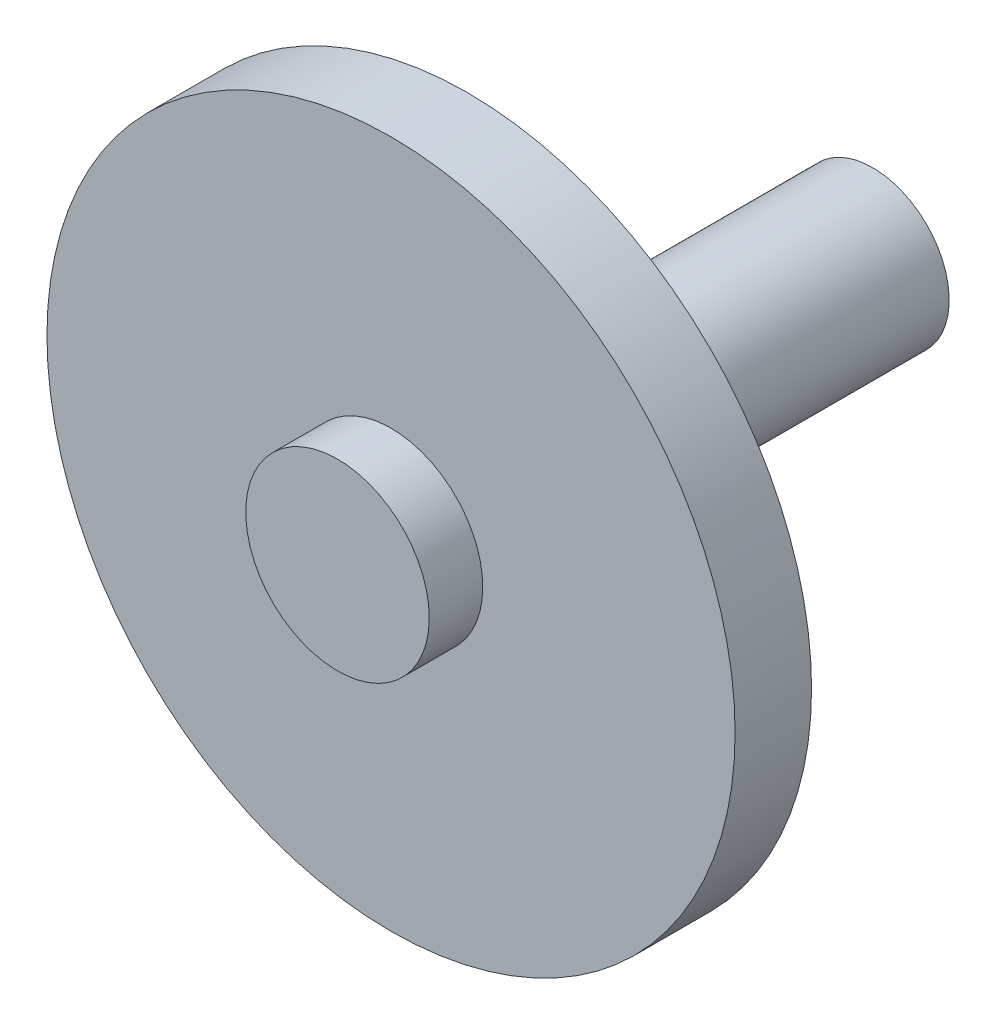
ISO-10303-21;
HEADER;
FILE_DESCRIPTION(('STEP AP214'),'2;1');
FILE_NAME('part.step','',(''),(''),'','','');
FILE_SCHEMA(('AUTOMOTIVE_DESIGN { 1 0 10303 214 1 1 1 1 }'));
ENDSEC;
DATA;
#1=APPLICATION_CONTEXT('core data for automotive mechanical design processes');
#2=APPLICATION_PROTOCOL_DEFINITION('international standard','automotive_design',2000,#1);
#3=PRODUCT_CONTEXT('',#1,'mechanical');
#4=PRODUCT('Part','Part','',(#3));
#5=PRODUCT_RELATED_PRODUCT_CATEGORY('part','',(#4));
#6=PRODUCT_DEFINITION_FORMATION('','',#4);
#7=PRODUCT_DEFINITION_CONTEXT('part definition',#1,'design');
#8=PRODUCT_DEFINITION('design','',#6,#7);
#9=PRODUCT_DEFINITION_SHAPE('','',#8);
#10=(LENGTH_UNIT() NAMED_UNIT(*) SI_UNIT(.MILLI.,.METRE.));
#11=(NAMED_UNIT(*) PLANE_ANGLE_UNIT() SI_UNIT($,.RADIAN.));
#12=(NAMED_UNIT(*) SI_UNIT($,.STERADIAN.) SOLID_ANGLE_UNIT());
#13=UNCERTAINTY_MEASURE_WITH_UNIT(LENGTH_MEASURE(1.E-05),#10,'distance_accuracy_value','');
#14=(GEOMETRIC_REPRESENTATION_CONTEXT(3) GLOBAL_UNCERTAINTY_ASSIGNED_CONTEXT((#13)) GLOBAL_UNIT_ASSIGNED_CONTEXT((#10,
#11,#12)) REPRESENTATION_CONTEXT('',''));
#15=CARTESIAN_POINT('',(0.,0.,0.));
#16=DIRECTION('',(0.,0.,1.));
#17=DIRECTION('',(1.,0.,0.));
#18=AXIS2_PLACEMENT_3D('',#15,#16,#17);
#19=CARTESIAN_POINT('',(0.,0.,5.));
#20=DIRECTION('',(0.,0.,-1.));
#21=DIRECTION('',(-1.,0.,0.));
#22=AXIS2_PLACEMENT_3D('',#19,#20,#21);
#23=CYLINDRICAL_SURFACE('',#22,22.5);
#24=CARTESIAN_POINT('',(0.,0.,5.));
#25=DIRECTION('',(0.,0.,1.));
#26=DIRECTION('',(1.,0.,0.));
#27=AXIS2_PLACEMENT_3D('',#24,#25,#26);
#28=CIRCLE('',#27,22.5);
#29=CARTESIAN_POINT('',(22.5,0.,5.));
#30=VERTEX_POINT('',#29);
#31=EDGE_CURVE('E36',#30,#30,#28,.T.);
#32=ORIENTED_EDGE('',*,*,#31,.F.);
#33=EDGE_LOOP('',(#32));
#34=FACE_BOUND('',#33,.T.);
#35=CARTESIAN_POINT('',(0.,0.,0.));
#36=DIRECTION('',(0.,0.,1.));
#37=DIRECTION('',(1.,0.,0.));
#38=AXIS2_PLACEMENT_3D('',#35,#36,#37);
#39=CIRCLE('',#38,22.5);
#40=CARTESIAN_POINT('',(22.5,0.,0.));
#41=VERTEX_POINT('',#40);
#42=EDGE_CURVE('E40',#41,#41,#39,.T.);
#43=ORIENTED_EDGE('',*,*,#42,.T.);
#44=EDGE_LOOP('',(#43));
#45=FACE_BOUND('',#44,.T.);
#46=ADVANCED_FACE('F30',(#34,#45),#23,.T.);
#47=CARTESIAN_POINT('',(0.,0.,5.));
#48=DIRECTION('',(0.,0.,1.));
#49=DIRECTION('',(1.,0.,0.));
#50=AXIS2_PLACEMENT_3D('',#47,#48,#49);
#51=PLANE('',#50);
#52=CARTESIAN_POINT('',(0.,0.,5.));
#53=DIRECTION('',(0.,0.,1.));
#54=DIRECTION('',(1.,0.,0.));
#55=AXIS2_PLACEMENT_3D('',#52,#53,#54);
#56=CIRCLE('',#55,6.);
#57=CARTESIAN_POINT('',(6.,0.,5.));
#58=VERTEX_POINT('',#57);
#59=EDGE_CURVE('E47',#58,#58,#56,.T.);
#60=ORIENTED_EDGE('',*,*,#59,.F.);
#61=EDGE_LOOP('',(#60));
#62=FACE_BOUND('',#61,.T.);
#63=ORIENTED_EDGE('',*,*,#31,.T.);
#64=EDGE_LOOP('',(#63));
#65=FACE_BOUND('',#64,.T.);
#66=ADVANCED_FACE('F105',(#62,#65),#51,.T.);
#67=CARTESIAN_POINT('',(0.,0.,0.));
#68=DIRECTION('',(0.,0.,1.));
#69=DIRECTION('',(1.,0.,0.));
#70=AXIS2_PLACEMENT_3D('',#67,#68,#69);
#71=PLANE('',#70);
#72=CARTESIAN_POINT('',(0.,0.,0.));
#73=DIRECTION('',(0.,0.,1.));
#74=DIRECTION('',(1.,0.,0.));
#75=AXIS2_PLACEMENT_3D('',#72,#73,#74);
#76=CIRCLE('',#75,7.5);
#77=CARTESIAN_POINT('',(7.5,0.,0.));
#78=VERTEX_POINT('',#77);
#79=EDGE_CURVE('E10',#78,#78,#76,.F.);
#80=ORIENTED_EDGE('',*,*,#79,.F.);
#81=EDGE_LOOP('',(#80));
#82=FACE_BOUND('',#81,.T.);
#83=ORIENTED_EDGE('',*,*,#42,.F.);
#84=EDGE_LOOP('',(#83));
#85=FACE_BOUND('',#84,.T.);
#86=ADVANCED_FACE('F110',(#82,#85),#71,.F.);
#87=CARTESIAN_POINT('',(0.,0.,8.5));
#88=DIRECTION('',(0.,0.,-1.));
#89=DIRECTION('',(-1.,0.,0.));
#90=AXIS2_PLACEMENT_3D('',#87,#88,#89);
#91=CYLINDRICAL_SURFACE('',#90,6.);
#92=CARTESIAN_POINT('',(0.,0.,8.5));
#93=DIRECTION('',(0.,0.,1.));
#94=DIRECTION('',(1.,0.,0.));
#95=AXIS2_PLACEMENT_3D('',#92,#93,#94);
#96=CIRCLE('',#95,6.);
#97=CARTESIAN_POINT('',(6.,0.,8.5));
#98=VERTEX_POINT('',#97);
#99=EDGE_CURVE('E45',#98,#98,#96,.T.);
#100=ORIENTED_EDGE('',*,*,#99,.F.);
#101=EDGE_LOOP('',(#100));
#102=FACE_BOUND('',#101,.T.);
#103=ORIENTED_EDGE('',*,*,#59,.T.);
#104=EDGE_LOOP('',(#103));
#105=FACE_BOUND('',#104,.T.);
#106=ADVANCED_FACE('F101',(#102,#105),#91,.T.);
#107=CARTESIAN_POINT('',(0.,0.,8.5));
#108=DIRECTION('',(0.,0.,1.));
#109=DIRECTION('',(1.,0.,0.));
#110=AXIS2_PLACEMENT_3D('',#107,#108,#109);
#111=PLANE('',#110);
#112=ORIENTED_EDGE('',*,*,#99,.T.);
#113=EDGE_LOOP('',(#112));
#114=FACE_BOUND('',#113,.T.);
#115=ADVANCED_FACE('F96',(#114),#111,.T.);
#116=CARTESIAN_POINT('',(0.,0.,-2.));
#117=DIRECTION('',(0.,0.,1.));
#118=DIRECTION('',(1.,0.,0.));
#119=AXIS2_PLACEMENT_3D('',#116,#117,#118);
#120=CYLINDRICAL_SURFACE('',#119,7.5);
#121=CARTESIAN_POINT('',(0.,0.,-2.));
#122=DIRECTION('',(0.,0.,-1.));
#123=DIRECTION('',(-1.,0.,0.));
#124=AXIS2_PLACEMENT_3D('',#121,#122,#123);
#125=CIRCLE('',#124,7.5);
#126=CARTESIAN_POINT('',(-7.5,0.,-2.));
#127=VERTEX_POINT('',#126);
#128=EDGE_CURVE('E50',#127,#127,#125,.T.);
#129=ORIENTED_EDGE('',*,*,#128,.F.);
#130=EDGE_LOOP('',(#129));
#131=FACE_BOUND('',#130,.T.);
#132=ORIENTED_EDGE('',*,*,#79,.T.);
#133=EDGE_LOOP('',(#132));
#134=FACE_BOUND('',#133,.T.);
#135=ADVANCED_FACE('F91',(#131,#134),#120,.T.);
#136=CARTESIAN_POINT('',(0.,0.,-2.));
#137=DIRECTION('',(0.,0.,-1.));
#138=DIRECTION('',(-1.,0.,0.));
#139=AXIS2_PLACEMENT_3D('',#136,#137,#138);
#140=PLANE('',#139);
#141=CARTESIAN_POINT('',(0.,0.,-2.));
#142=DIRECTION('',(0.,0.,-1.));
#143=DIRECTION('',(-1.,0.,0.));
#144=AXIS2_PLACEMENT_3D('',#141,#142,#143);
#145=CIRCLE('',#144,5.5);
#146=CARTESIAN_POINT('',(-5.5,0.,-2.));
#147=VERTEX_POINT('',#146);
#148=EDGE_CURVE('E56',#147,#147,#145,.T.);
#149=ORIENTED_EDGE('',*,*,#148,.F.);
#150=EDGE_LOOP('',(#149));
#151=FACE_BOUND('',#150,.T.);
#152=ORIENTED_EDGE('',*,*,#128,.T.);
#153=EDGE_LOOP('',(#152));
#154=FACE_BOUND('',#153,.T.);
#155=ADVANCED_FACE('F85',(#151,#154),#140,.T.);
#156=CARTESIAN_POINT('',(0.,0.,-8.));
#157=DIRECTION('',(0.,0.,1.));
#158=DIRECTION('',(1.,0.,0.));
#159=AXIS2_PLACEMENT_3D('',#156,#157,#158);
#160=CYLINDRICAL_SURFACE('',#159,5.5);
#161=CARTESIAN_POINT('',(0.,0.,-8.));
#162=DIRECTION('',(0.,0.,-1.));
#163=DIRECTION('',(-1.,0.,0.));
#164=AXIS2_PLACEMENT_3D('',#161,#162,#163);
#165=CIRCLE('',#164,5.5);
#166=CARTESIAN_POINT('',(-5.5,0.,-8.));
#167=VERTEX_POINT('',#166);
#168=EDGE_CURVE('E55',#167,#167,#165,.T.);
#169=ORIENTED_EDGE('',*,*,#168,.F.);
#170=EDGE_LOOP('',(#169));
#171=FACE_BOUND('',#170,.T.);
#172=ORIENTED_EDGE('',*,*,#148,.T.);
#173=EDGE_LOOP('',(#172));
#174=FACE_BOUND('',#173,.T.);
#175=ADVANCED_FACE('F79',(#171,#174),#160,.T.);
#176=CARTESIAN_POINT('',(0.,0.,-8.));
#177=DIRECTION('',(0.,0.,-1.));
#178=DIRECTION('',(-1.,0.,0.));
#179=AXIS2_PLACEMENT_3D('',#176,#177,#178);
#180=PLANE('',#179);
#181=CARTESIAN_POINT('',(0.,0.,-8.));
#182=DIRECTION('',(0.,0.,-1.));
#183=DIRECTION('',(-1.,0.,0.));
#184=AXIS2_PLACEMENT_3D('',#181,#182,#183);
#185=CIRCLE('',#184,5.);
#186=CARTESIAN_POINT('',(-5.,0.,-8.));
#187=VERTEX_POINT('',#186);
#188=EDGE_CURVE('E62',#187,#187,#185,.T.);
#189=ORIENTED_EDGE('',*,*,#188,.F.);
#190=EDGE_LOOP('',(#189));
#191=FACE_BOUND('',#190,.T.);
#192=ORIENTED_EDGE('',*,*,#168,.T.);
#193=EDGE_LOOP('',(#192));
#194=FACE_BOUND('',#193,.T.);
#195=ADVANCED_FACE('F73',(#191,#194),#180,.T.);
#196=CARTESIAN_POINT('',(0.,0.,-26.5));
#197=DIRECTION('',(0.,0.,1.));
#198=DIRECTION('',(1.,0.,0.));
#199=AXIS2_PLACEMENT_3D('',#196,#197,#198);
#200=CYLINDRICAL_SURFACE('',#199,5.);
#201=CARTESIAN_POINT('',(0.,0.,-26.5));
#202=DIRECTION('',(0.,0.,-1.));
#203=DIRECTION('',(-1.,0.,0.));
#204=AXIS2_PLACEMENT_3D('',#201,#202,#203);
#205=CIRCLE('',#204,5.);
#206=CARTESIAN_POINT('',(-5.,0.,-26.5));
#207=VERTEX_POINT('',#206);
#208=EDGE_CURVE('E59',#207,#207,#205,.T.);
#209=ORIENTED_EDGE('',*,*,#208,.F.);
#210=EDGE_LOOP('',(#209));
#211=FACE_BOUND('',#210,.T.);
#212=ORIENTED_EDGE('',*,*,#188,.T.);
#213=EDGE_LOOP('',(#212));
#214=FACE_BOUND('',#213,.T.);
#215=ADVANCED_FACE('F70',(#211,#214),#200,.T.);
#216=CARTESIAN_POINT('',(0.,0.,-26.5));
#217=DIRECTION('',(0.,0.,-1.));
#218=DIRECTION('',(-1.,0.,0.));
#219=AXIS2_PLACEMENT_3D('',#216,#217,#218);
#220=PLANE('',#219);
#221=ORIENTED_EDGE('',*,*,#208,.T.);
#222=EDGE_LOOP('',(#221));
#223=FACE_BOUND('',#222,.T.);
#224=ADVANCED_FACE('F68',(#223),#220,.T.);
#225=CLOSED_SHELL('',(#46,#66,#86,#106,#115,#135,#155,#175,#195,#215,#224));
#226=MANIFOLD_SOLID_BREP('B2',#225);
#227=ADVANCED_BREP_SHAPE_REPRESENTATION('',(#18,#226),#14);
#228=SHAPE_DEFINITION_REPRESENTATION(#9,#227);
ENDSEC;
END-ISO-10303-21;
